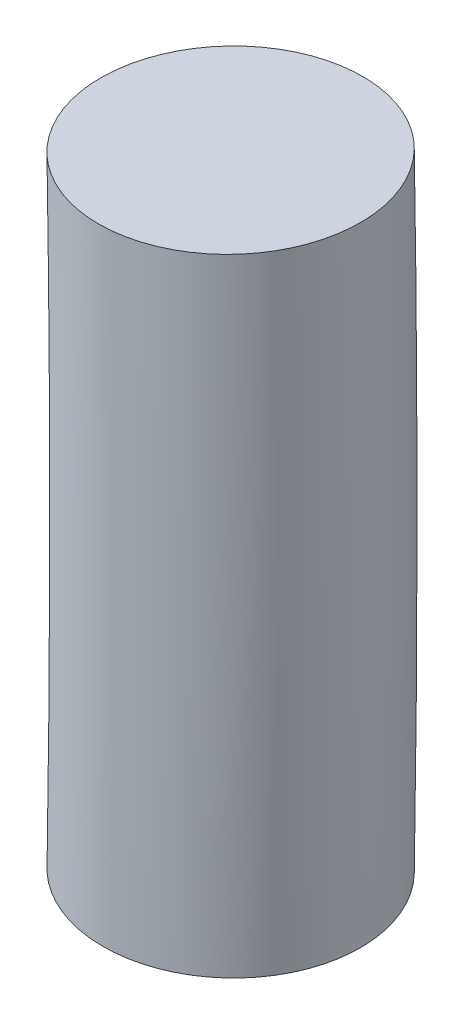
ISO-10303-21;
HEADER;
FILE_DESCRIPTION(('STEP AP214'),'2;1');
FILE_NAME('part.step','',(''),(''),'','','');
FILE_SCHEMA(('AUTOMOTIVE_DESIGN { 1 0 10303 214 1 1 1 1 }'));
ENDSEC;
DATA;
#1=APPLICATION_CONTEXT('core data for automotive mechanical design processes');
#2=APPLICATION_PROTOCOL_DEFINITION('international standard','automotive_design',2000,#1);
#3=PRODUCT_CONTEXT('',#1,'mechanical');
#4=PRODUCT('Part','Part','',(#3));
#5=PRODUCT_RELATED_PRODUCT_CATEGORY('part','',(#4));
#6=PRODUCT_DEFINITION_FORMATION('','',#4);
#7=PRODUCT_DEFINITION_CONTEXT('part definition',#1,'design');
#8=PRODUCT_DEFINITION('design','',#6,#7);
#9=PRODUCT_DEFINITION_SHAPE('','',#8);
#10=(LENGTH_UNIT() NAMED_UNIT(*) SI_UNIT(.MILLI.,.METRE.));
#11=(NAMED_UNIT(*) PLANE_ANGLE_UNIT() SI_UNIT($,.RADIAN.));
#12=(NAMED_UNIT(*) SI_UNIT($,.STERADIAN.) SOLID_ANGLE_UNIT());
#13=UNCERTAINTY_MEASURE_WITH_UNIT(LENGTH_MEASURE(1.E-05),#10,'distance_accuracy_value','');
#14=(GEOMETRIC_REPRESENTATION_CONTEXT(3) GLOBAL_UNCERTAINTY_ASSIGNED_CONTEXT((#13)) GLOBAL_UNIT_ASSIGNED_CONTEXT((#10,
#11,#12)) REPRESENTATION_CONTEXT('',''));
#15=CARTESIAN_POINT('',(0.,0.,0.));
#16=DIRECTION('',(0.,0.,1.));
#17=DIRECTION('',(1.,0.,0.));
#18=AXIS2_PLACEMENT_3D('',#15,#16,#17);
#19=CARTESIAN_POINT('',(-1091.48459972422,19.05,0.));
#20=DIRECTION('',(0.,0.,1.));
#21=DIRECTION('',(1.,0.,0.));
#22=AXIS2_PLACEMENT_3D('',#19,#20,#21);
#23=TOROIDAL_SURFACE('',#22,1091.48459972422,7.9375);
#24=CARTESIAN_POINT('',(-0.166238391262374,0.000967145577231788,0.));
#25=DIRECTION('',(0.0174524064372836,0.999847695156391,0.));
#26=DIRECTION('',(0.,0.,1.));
#27=AXIS2_PLACEMENT_3D('',#24,#25,#26);
#28=CIRCLE('',#27,7.9375);
#29=CARTESIAN_POINT('',(-0.166238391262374,0.000967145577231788,7.9375));
#30=VERTEX_POINT('',#29);
#31=EDGE_CURVE('E12',#30,#30,#28,.T.);
#32=ORIENTED_EDGE('',*,*,#31,.T.);
#33=EDGE_LOOP('',(#32));
#34=FACE_BOUND('',#33,.T.);
#35=CARTESIAN_POINT('',(-0.166238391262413,38.0990328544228,0.));
#36=DIRECTION('',(-0.0174524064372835,0.999847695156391,0.));
#37=DIRECTION('',(0.,0.,1.));
#38=AXIS2_PLACEMENT_3D('',#35,#36,#37);
#39=CIRCLE('',#38,7.9375);
#40=CARTESIAN_POINT('',(-0.166238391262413,38.0990328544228,7.9375));
#41=VERTEX_POINT('',#40);
#42=EDGE_CURVE('E65',#41,#41,#39,.T.);
#43=ORIENTED_EDGE('',*,*,#42,.F.);
#44=EDGE_LOOP('',(#43));
#45=FACE_BOUND('',#44,.T.);
#46=ADVANCED_FACE('F57',(#34,#45),#23,.T.);
#47=CARTESIAN_POINT('',(-17.7674785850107,37.7918020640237,0.));
#48=DIRECTION('',(-0.0174524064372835,0.999847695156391,0.));
#49=DIRECTION('',(0.,0.,1.));
#50=AXIS2_PLACEMENT_3D('',#47,#48,#49);
#51=PLANE('',#50);
#52=ORIENTED_EDGE('',*,*,#42,.T.);
#53=EDGE_LOOP('',(#52));
#54=FACE_BOUND('',#53,.T.);
#55=ADVANCED_FACE('F74',(#54),#51,.T.);
#56=CARTESIAN_POINT('',(-17.7674785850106,0.308197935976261,0.));
#57=DIRECTION('',(0.0174524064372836,0.999847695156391,0.));
#58=DIRECTION('',(0.,0.,1.));
#59=AXIS2_PLACEMENT_3D('',#56,#57,#58);
#60=PLANE('',#59);
#61=ORIENTED_EDGE('',*,*,#31,.F.);
#62=EDGE_LOOP('',(#61));
#63=FACE_BOUND('',#62,.T.);
#64=ADVANCED_FACE('F59',(#63),#60,.F.);
#65=CLOSED_SHELL('',(#46,#55,#64));
#66=MANIFOLD_SOLID_BREP('B2',#65);
#67=ADVANCED_BREP_SHAPE_REPRESENTATION('',(#18,#66),#14);
#68=SHAPE_DEFINITION_REPRESENTATION(#9,#67);
ENDSEC;
END-ISO-10303-21;
